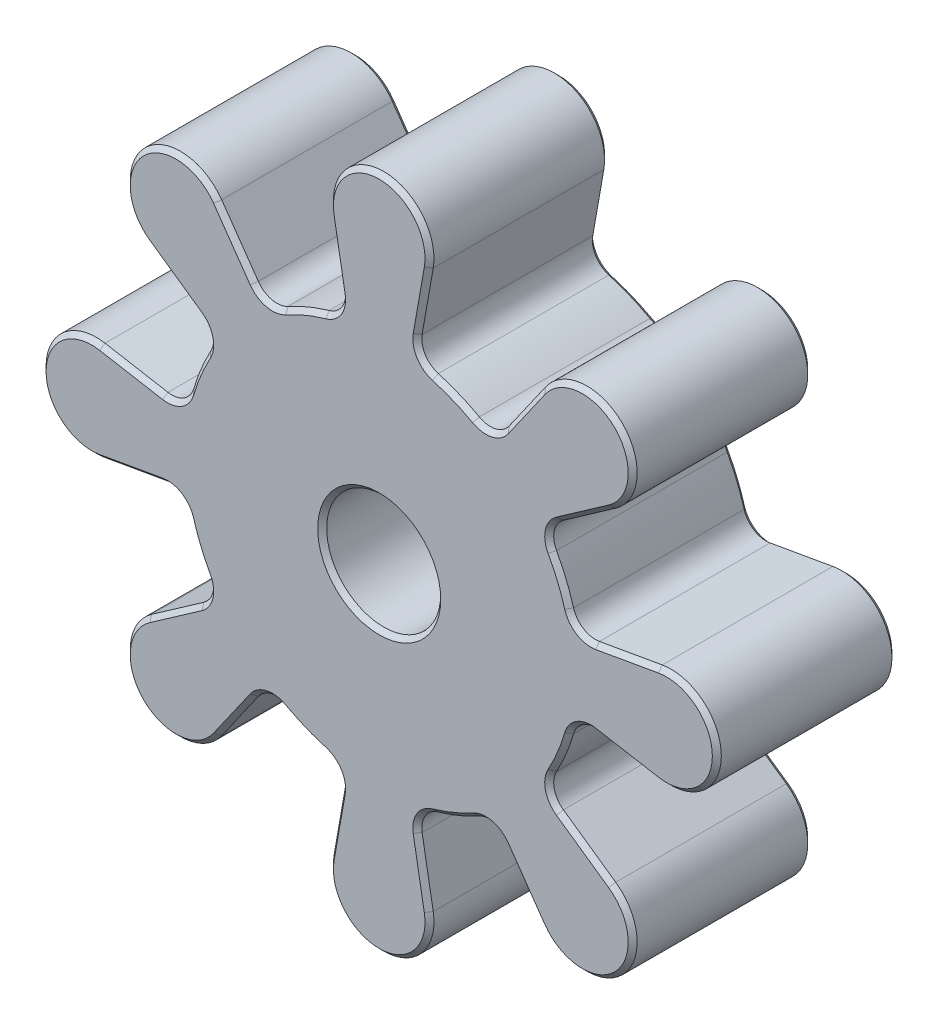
from build123d import *

# Parameters (mm, degrees)
SKETCH_1_R      = 3.175
EXTRUDE_1_DEPTH = 10
CHAMFER_1_SIZE  = 0.25


with BuildPart() as part:
    # Sketch 1 → Extrude 1 (new body)
    with BuildSketch(Plane.XY):
        with BuildLine():
            Line((-2.14012567, 12.01269845), (-2.757461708, 15.513785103))
            ThreePointArc((-2.757461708, 15.513785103), (0, 18.8), (2.757461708, 15.513785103))
            Line((2.757461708, 15.513785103), (2.14012567, 12.01269845))
            ThreePointArc((2.14012567, 12.01269845), (2.313560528, 11.119567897), (3.039865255, 10.571623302))
            ThreePointArc((3.039865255, 10.571623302), (4.209517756, 10.162674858), (5.325757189, 9.62477586))
            ThreePointArc((5.325757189, 9.62477586), (6.226787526, 9.498656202), (6.980963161, 10.007557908))
            Line((6.980963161, 10.007557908), (9.020082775, 12.919722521))
            ThreePointArc((9.020082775, 12.919722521), (13.293607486, 13.293607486), (12.919722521, 9.020082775))
            Line((12.919722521, 9.020082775), (10.007557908, 6.980963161))
            ThreePointArc((10.007557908, 6.980963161), (9.498656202, 6.226787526), (9.62477586, 5.325757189))
            ThreePointArc((9.62477586, 5.325757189), (10.162674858, 4.209517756), (10.571623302, 3.039865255))
            ThreePointArc((10.571623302, 3.039865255), (11.119567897, 2.313560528), (12.01269845, 2.14012567))
            Line((12.01269845, 2.14012567), (15.513785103, 2.757461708))
            ThreePointArc((15.513785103, 2.757461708), (18.8, 0), (15.513785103, -2.757461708))
            Line((15.513785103, -2.757461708), (12.01269845, -2.14012567))
            ThreePointArc((12.01269845, -2.14012567), (11.119567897, -2.313560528), (10.571623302, -3.039865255))
            ThreePointArc((10.571623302, -3.039865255), (10.162674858, -4.209517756), (9.62477586, -5.325757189))
            ThreePointArc((9.62477586, -5.325757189), (9.498656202, -6.226787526), (10.007557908, -6.980963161))
            Line((10.007557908, -6.980963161), (12.919722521, -9.020082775))
            ThreePointArc((12.919722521, -9.020082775), (13.293607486, -13.293607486), (9.020082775, -12.919722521))
            Line((9.020082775, -12.919722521), (6.980963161, -10.007557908))
            ThreePointArc((6.980963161, -10.007557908), (6.226787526, -9.498656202), (5.325757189, -9.62477586))
            ThreePointArc((5.325757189, -9.62477586), (4.209517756, -10.162674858), (3.039865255, -10.571623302))
            ThreePointArc((3.039865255, -10.571623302), (2.313560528, -11.119567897), (2.14012567, -12.01269845))
            Line((2.14012567, -12.01269845), (2.757461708, -15.513785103))
            ThreePointArc((2.757461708, -15.513785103), (0, -18.8), (-2.757461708, -15.513785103))
            Line((-2.757461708, -15.513785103), (-2.14012567, -12.01269845))
            ThreePointArc((-2.14012567, -12.01269845), (-2.313560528, -11.119567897), (-3.039865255, -10.571623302))
            ThreePointArc((-3.039865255, -10.571623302), (-4.209517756, -10.162674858), (-5.325757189, -9.62477586))
            ThreePointArc((-5.325757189, -9.62477586), (-6.226787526, -9.498656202), (-6.980963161, -10.007557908))
            Line((-6.980963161, -10.007557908), (-9.020082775, -12.919722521))
            ThreePointArc((-9.020082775, -12.919722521), (-13.293607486, -13.293607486), (-12.919722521, -9.020082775))
            Line((-12.919722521, -9.020082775), (-10.007557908, -6.980963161))
            ThreePointArc((-10.007557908, -6.980963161), (-9.498656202, -6.226787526), (-9.62477586, -5.325757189))
            ThreePointArc((-9.62477586, -5.325757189), (-10.162674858, -4.209517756), (-10.571623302, -3.039865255))
            ThreePointArc((-10.571623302, -3.039865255), (-11.119567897, -2.313560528), (-12.01269845, -2.14012567))
            Line((-12.01269845, -2.14012567), (-15.513785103, -2.757461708))
            ThreePointArc((-15.513785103, -2.757461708), (-18.8, 0), (-15.513785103, 2.757461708))
            Line((-15.513785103, 2.757461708), (-12.01269845, 2.14012567))
            ThreePointArc((-12.01269845, 2.14012567), (-11.119567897, 2.313560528), (-10.571623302, 3.039865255))
            ThreePointArc((-10.571623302, 3.039865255), (-10.162674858, 4.209517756), (-9.62477586, 5.325757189))
            ThreePointArc((-9.62477586, 5.325757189), (-9.498656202, 6.226787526), (-10.007557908, 6.980963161))
            Line((-10.007557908, 6.980963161), (-12.919722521, 9.020082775))
            ThreePointArc((-12.919722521, 9.020082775), (-13.293607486, 13.293607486), (-9.020082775, 12.919722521))
            Line((-9.020082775, 12.919722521), (-6.980963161, 10.007557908))
            ThreePointArc((-6.980963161, 10.007557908), (-6.226787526, 9.498656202), (-5.325757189, 9.62477586))
            ThreePointArc((-5.325757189, 9.62477586), (-4.209517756, 10.162674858), (-3.039865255, 10.571623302))
            ThreePointArc((-3.039865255, 10.571623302), (-2.313560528, 11.119567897), (-2.14012567, 12.01269845))
        make_face()
        Circle(SKETCH_1_R, mode=Mode.SUBTRACT)
    extrude(amount=EXTRUDE_1_DEPTH)

    # Chamfer 1
    chamfer_1_edges = [part.edges().sort_by_distance(p)[0] for p in [
        (0, 18.8, 10),
        (13.293607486, -13.293607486, 10),
        (11.463640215, -8.000522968, 10),
        (9.498656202, -6.226787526, 10),
        (-3.175, 0, 0),
        (10.162674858, -4.209517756, 10),
        (-3.175, 0, 10),
        (11.119567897, -2.313560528, 10),
        (13.763241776, -2.448793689, 10),
        (18.8, 0, 10),
        (13.763241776, 2.448793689, 10),
        (11.119567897, 2.313560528, 10),
        (10.162674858, 4.209517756, 10),
        (-2.448793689, 13.763241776, 10),
        (9.498656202, 6.226787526, 10),
        (11.463640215, 8.000522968, 10),
        (13.293607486, 13.293607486, 10),
        (8.000522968, 11.463640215, 10),
        (6.226787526, 9.498656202, 10),
        (4.209517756, 10.162674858, 10),
        (-2.313560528, 11.119567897, 10),
        (-4.209517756, 10.162674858, 10),
        (-6.226787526, 9.498656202, 10),
        (-8.000522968, 11.463640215, 10),
        (-13.293607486, 13.293607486, 10),
        (-11.463640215, 8.000522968, 10),
        (-9.498656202, 6.226787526, 10),
        (-10.162674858, 4.209517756, 10),
        (4.209517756, 10.162674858, 0),
        (2.313560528, 11.119567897, 10),
        (-11.119567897, 2.313560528, 10),
        (6.226787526, 9.498656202, 0),
        (8.000522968, 11.463640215, 0),
        (13.293607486, 13.293607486, 0),
        (11.463640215, 8.000522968, 0),
        (9.498656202, 6.226787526, 0),
        (10.162674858, 4.209517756, 0),
        (11.119567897, 2.313560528, 0),
        (13.763241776, 2.448793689, 0),
        (-13.763241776, 2.448793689, 10),
        (18.8, 0, 0),
        (13.763241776, -2.448793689, 0),
        (11.119567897, -2.313560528, 0),
        (10.162674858, -4.209517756, 0),
        (9.498656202, -6.226787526, 0),
        (11.463640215, -8.000522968, 0),
        (13.293607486, -13.293607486, 0),
        (-18.8, 0, 10),
        (8.000522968, -11.463640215, 0),
        (6.226787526, -9.498656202, 0),
        (4.209517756, -10.162674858, 0),
        (2.313560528, -11.119567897, 0),
        (2.448793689, -13.763241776, 0),
        (0, -18.8, 0),
        (-2.448793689, -13.763241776, 0),
        (-2.313560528, -11.119567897, 0),
        (-13.763241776, -2.448793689, 10),
        (-4.209517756, -10.162674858, 0),
        (-6.226787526, -9.498656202, 0),
        (-8.000522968, -11.463640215, 0),
        (-13.293607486, -13.293607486, 0),
        (-11.463640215, -8.000522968, 0),
        (-9.498656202, -6.226787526, 0),
        (-10.162674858, -4.209517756, 0),
        (-11.119567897, -2.313560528, 10),
        (-11.119567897, -2.313560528, 0),
        (-13.763241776, -2.448793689, 0),
        (-18.8, 0, 0),
        (-13.763241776, 2.448793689, 0),
        (-11.119567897, 2.313560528, 0),
        (-10.162674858, 4.209517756, 0),
        (-9.498656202, 6.226787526, 0),
        (-11.463640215, 8.000522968, 0),
        (-10.162674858, -4.209517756, 10),
        (-13.293607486, 13.293607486, 0),
        (-8.000522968, 11.463640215, 0),
        (-6.226787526, 9.498656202, 0),
        (-4.209517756, 10.162674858, 0),
        (-2.313560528, 11.119567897, 0),
        (-2.448793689, 13.763241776, 0),
        (0, 18.8, 0),
        (-9.498656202, -6.226787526, 10),
        (2.448793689, 13.763241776, 0),
        (2.313560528, 11.119567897, 0),
        (-11.463640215, -8.000522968, 10),
        (-13.293607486, -13.293607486, 10),
        (-8.000522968, -11.463640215, 10),
        (2.448793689, 13.763241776, 10),
        (-6.226787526, -9.498656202, 10),
        (-4.209517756, -10.162674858, 10),
        (-2.313560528, -11.119567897, 10),
        (-2.448793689, -13.763241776, 10),
        (0, -18.8, 10),
        (2.448793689, -13.763241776, 10),
        (2.313560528, -11.119567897, 10),
        (4.209517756, -10.162674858, 10),
        (6.226787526, -9.498656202, 10),
        (8.000522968, -11.463640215, 10),
    ]]
    chamfer(chamfer_1_edges, length=CHAMFER_1_SIZE)


solid = part.part
